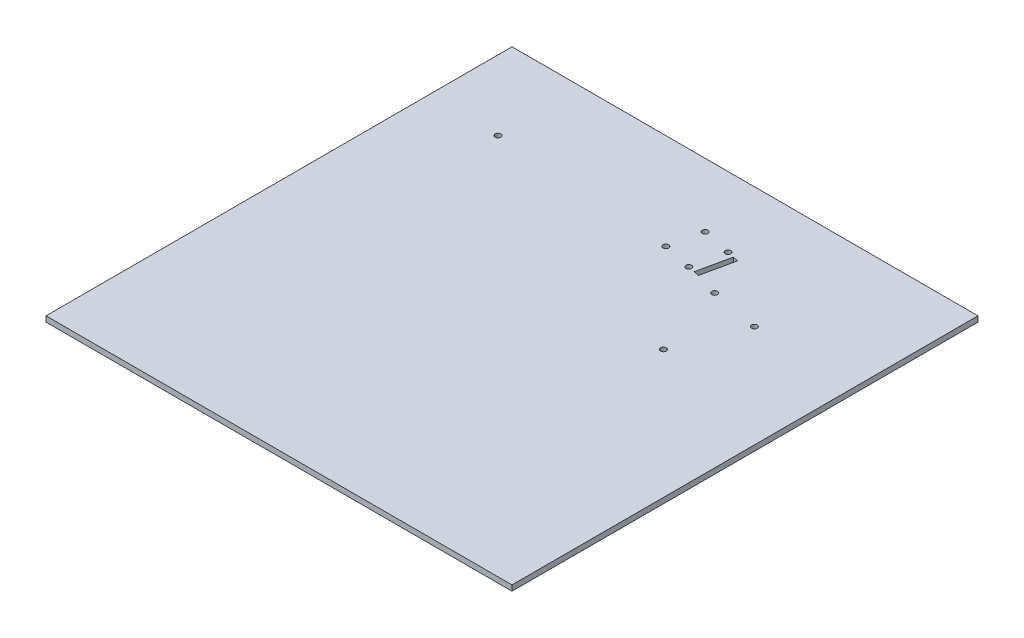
ISO-10303-21;
HEADER;
FILE_DESCRIPTION(('STEP AP214'),'2;1');
FILE_NAME('part.step','',(''),(''),'','','');
FILE_SCHEMA(('AUTOMOTIVE_DESIGN { 1 0 10303 214 1 1 1 1 }'));
ENDSEC;
DATA;
#1=APPLICATION_CONTEXT('core data for automotive mechanical design processes');
#2=APPLICATION_PROTOCOL_DEFINITION('international standard','automotive_design',2000,#1);
#3=PRODUCT_CONTEXT('',#1,'mechanical');
#4=PRODUCT('Part','Part','',(#3));
#5=PRODUCT_RELATED_PRODUCT_CATEGORY('part','',(#4));
#6=PRODUCT_DEFINITION_FORMATION('','',#4);
#7=PRODUCT_DEFINITION_CONTEXT('part definition',#1,'design');
#8=PRODUCT_DEFINITION('design','',#6,#7);
#9=PRODUCT_DEFINITION_SHAPE('','',#8);
#10=(LENGTH_UNIT() NAMED_UNIT(*) SI_UNIT(.MILLI.,.METRE.));
#11=(NAMED_UNIT(*) PLANE_ANGLE_UNIT() SI_UNIT($,.RADIAN.));
#12=(NAMED_UNIT(*) SI_UNIT($,.STERADIAN.) SOLID_ANGLE_UNIT());
#13=UNCERTAINTY_MEASURE_WITH_UNIT(LENGTH_MEASURE(1.E-05),#10,'distance_accuracy_value','');
#14=(GEOMETRIC_REPRESENTATION_CONTEXT(3) GLOBAL_UNCERTAINTY_ASSIGNED_CONTEXT((#13)) GLOBAL_UNIT_ASSIGNED_CONTEXT((#10,
#11,#12)) REPRESENTATION_CONTEXT('',''));
#15=CARTESIAN_POINT('',(0.,0.,0.));
#16=DIRECTION('',(0.,0.,1.));
#17=DIRECTION('',(1.,0.,0.));
#18=AXIS2_PLACEMENT_3D('',#15,#16,#17);
#19=CARTESIAN_POINT('',(0.,2.999994,0.));
#20=DIRECTION('',(0.,1.,0.));
#21=DIRECTION('',(0.,0.,1.));
#22=AXIS2_PLACEMENT_3D('',#19,#20,#21);
#23=PLANE('',#22);
#24=CARTESIAN_POINT('',(25.0680233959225,2.999994,-71.2861191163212));
#25=DIRECTION('',(0.,1.,0.));
#26=DIRECTION('',(0.,0.,1.));
#27=AXIS2_PLACEMENT_3D('',#24,#25,#26);
#28=CIRCLE('',#27,1.5499842);
#29=CARTESIAN_POINT('',(25.0680233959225,2.999994,-69.7361349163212));
#30=VERTEX_POINT('',#29);
#31=EDGE_CURVE('E287',#30,#30,#28,.T.);
#32=ORIENTED_EDGE('',*,*,#31,.F.);
#33=EDGE_LOOP('',(#32));
#34=FACE_BOUND('',#33,.T.);
#35=CARTESIAN_POINT('',(12.9667589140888,2.999994,-92.2781036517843));
#36=DIRECTION('',(0.,1.,0.));
#37=DIRECTION('',(0.,0.,1.));
#38=AXIS2_PLACEMENT_3D('',#35,#36,#37);
#39=CIRCLE('',#38,1.5499842);
#40=CARTESIAN_POINT('',(12.9667589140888,2.999994,-90.7281194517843));
#41=VERTEX_POINT('',#40);
#42=EDGE_CURVE('E299',#41,#41,#39,.T.);
#43=ORIENTED_EDGE('',*,*,#42,.F.);
#44=EDGE_LOOP('',(#43));
#45=FACE_BOUND('',#44,.T.);
#46=DIRECTION('',(-0.977674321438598,0.,-0.210125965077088));
#47=VECTOR('',#46,1.);
#48=CARTESIAN_POINT('',(32.6243776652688,2.999994,-88.0532037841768));
#49=LINE('',#48,#47);
#50=CARTESIAN_POINT('',(35.5281771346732,2.999994,-87.4291067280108));
#51=VERTEX_POINT('',#50);
#52=CARTESIAN_POINT('',(32.6243776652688,2.999994,-88.0532037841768));
#53=VERTEX_POINT('',#52);
#54=EDGE_CURVE('E106',#51,#53,#49,.T.);
#55=ORIENTED_EDGE('',*,*,#54,.F.);
#56=DIRECTION('',(0.210125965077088,0.,-0.977674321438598));
#57=VECTOR('',#56,1.);
#58=CARTESIAN_POINT('',(35.5281771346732,2.999994,-87.4291067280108));
#59=LINE('',#58,#57);
#60=CARTESIAN_POINT('',(31.75,2.999994,-69.85));
#61=VERTEX_POINT('',#60);
#62=EDGE_CURVE('E98',#61,#51,#59,.T.);
#63=ORIENTED_EDGE('',*,*,#62,.F.);
#64=DIRECTION('',(0.977674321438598,0.,0.210125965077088));
#65=VECTOR('',#64,1.);
#66=CARTESIAN_POINT('',(31.75,2.999994,-69.85));
#67=LINE('',#66,#65);
#68=CARTESIAN_POINT('',(28.8462005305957,2.999994,-70.474097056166));
#69=VERTEX_POINT('',#68);
#70=EDGE_CURVE('E121',#69,#61,#67,.T.);
#71=ORIENTED_EDGE('',*,*,#70,.F.);
#72=DIRECTION('',(-0.210125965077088,0.,0.977674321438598));
#73=VECTOR('',#72,1.);
#74=CARTESIAN_POINT('',(28.8462005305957,2.999994,-70.474097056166));
#75=LINE('',#74,#73);
#76=EDGE_CURVE('E119',#53,#69,#75,.T.);
#77=ORIENTED_EDGE('',*,*,#76,.F.);
#78=EDGE_LOOP('',(#55,#63,#71,#77));
#79=FACE_BOUND('',#78,.T.);
#80=CARTESIAN_POINT('',(44.45,2.999994,-66.04));
#81=DIRECTION('',(0.,1.,0.));
#82=DIRECTION('',(0.,0.,1.));
#83=AXIS2_PLACEMENT_3D('',#80,#81,#82);
#84=CIRCLE('',#83,1.5499842);
#85=CARTESIAN_POINT('',(44.45,2.999994,-64.4900158));
#86=VERTEX_POINT('',#85);
#87=EDGE_CURVE('E137',#86,#86,#84,.T.);
#88=ORIENTED_EDGE('',*,*,#87,.F.);
#89=EDGE_LOOP('',(#88));
#90=FACE_BOUND('',#89,.T.);
#91=CARTESIAN_POINT('',(57.15,2.999994,-25.4));
#92=DIRECTION('',(0.,1.,0.));
#93=DIRECTION('',(0.,0.,1.));
#94=AXIS2_PLACEMENT_3D('',#91,#92,#93);
#95=CIRCLE('',#94,1.5499842);
#96=CARTESIAN_POINT('',(57.15,2.999994,-23.8500158));
#97=VERTEX_POINT('',#96);
#98=EDGE_CURVE('E149',#97,#97,#95,.T.);
#99=ORIENTED_EDGE('',*,*,#98,.F.);
#100=EDGE_LOOP('',(#99));
#101=FACE_BOUND('',#100,.T.);
#102=DIRECTION('',(0.,0.,-1.));
#103=VECTOR('',#102,1.);
#104=CARTESIAN_POINT('',(127.,2.999994,-127.));
#105=LINE('',#104,#103);
#106=CARTESIAN_POINT('',(127.,2.999994,127.));
#107=VERTEX_POINT('',#106);
#108=CARTESIAN_POINT('',(127.,2.999994,-127.));
#109=VERTEX_POINT('',#108);
#110=EDGE_CURVE('E155',#107,#109,#105,.T.);
#111=ORIENTED_EDGE('',*,*,#110,.T.);
#112=DIRECTION('',(-1.,0.,0.));
#113=VECTOR('',#112,1.);
#114=CARTESIAN_POINT('',(-127.,2.999994,-127.));
#115=LINE('',#114,#113);
#116=CARTESIAN_POINT('',(-127.,2.999994,-127.));
#117=VERTEX_POINT('',#116);
#118=EDGE_CURVE('E158',#109,#117,#115,.T.);
#119=ORIENTED_EDGE('',*,*,#118,.T.);
#120=DIRECTION('',(0.,0.,1.));
#121=VECTOR('',#120,1.);
#122=CARTESIAN_POINT('',(-127.,2.999994,-127.));
#123=LINE('',#122,#121);
#124=CARTESIAN_POINT('',(-127.,2.999994,127.));
#125=VERTEX_POINT('',#124);
#126=EDGE_CURVE('E161',#117,#125,#123,.T.);
#127=ORIENTED_EDGE('',*,*,#126,.T.);
#128=DIRECTION('',(1.,0.,0.));
#129=VECTOR('',#128,1.);
#130=CARTESIAN_POINT('',(-127.,2.999994,127.));
#131=LINE('',#130,#129);
#132=EDGE_CURVE('E163',#125,#107,#131,.T.);
#133=ORIENTED_EDGE('',*,*,#132,.T.);
#134=EDGE_LOOP('',(#111,#119,#127,#133));
#135=FACE_BOUND('',#134,.T.);
#136=CARTESIAN_POINT('',(71.12,2.999994,-60.96));
#137=DIRECTION('',(0.,1.,0.));
#138=DIRECTION('',(0.,0.,1.));
#139=AXIS2_PLACEMENT_3D('',#136,#137,#138);
#140=CIRCLE('',#139,1.5499842);
#141=CARTESIAN_POINT('',(71.12,2.999994,-59.4100158));
#142=VERTEX_POINT('',#141);
#143=EDGE_CURVE('E143',#142,#142,#140,.T.);
#144=ORIENTED_EDGE('',*,*,#143,.F.);
#145=EDGE_LOOP('',(#144));
#146=FACE_BOUND('',#145,.T.);
#147=CARTESIAN_POINT('',(9.1885817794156,2.999994,-74.6989969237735));
#148=DIRECTION('',(0.,1.,0.));
#149=DIRECTION('',(0.,0.,1.));
#150=AXIS2_PLACEMENT_3D('',#147,#148,#149);
#151=CIRCLE('',#150,1.5499842);
#152=CARTESIAN_POINT('',(9.1885817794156,2.999994,-73.1490127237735));
#153=VERTEX_POINT('',#152);
#154=EDGE_CURVE('E127',#153,#153,#151,.T.);
#155=ORIENTED_EDGE('',*,*,#154,.F.);
#156=EDGE_LOOP('',(#155));
#157=FACE_BOUND('',#156,.T.);
#158=CARTESIAN_POINT('',(28.8462005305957,2.999994,-88.865225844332));
#159=DIRECTION('',(0.,1.,0.));
#160=DIRECTION('',(0.,0.,1.));
#161=AXIS2_PLACEMENT_3D('',#158,#159,#160);
#162=CIRCLE('',#161,1.5499842);
#163=CARTESIAN_POINT('',(28.8462005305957,2.999994,-87.315241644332));
#164=VERTEX_POINT('',#163);
#165=EDGE_CURVE('E293',#164,#164,#162,.T.);
#166=ORIENTED_EDGE('',*,*,#165,.F.);
#167=EDGE_LOOP('',(#166));
#168=FACE_BOUND('',#167,.T.);
#169=CARTESIAN_POINT('',(-88.9,2.999994,-81.28));
#170=DIRECTION('',(0.,1.,0.));
#171=DIRECTION('',(0.,0.,1.));
#172=AXIS2_PLACEMENT_3D('',#169,#170,#171);
#173=CIRCLE('',#172,1.5499842);
#174=CARTESIAN_POINT('',(-88.9,2.999994,-79.7300158));
#175=VERTEX_POINT('',#174);
#176=EDGE_CURVE('E278',#175,#175,#173,.T.);
#177=ORIENTED_EDGE('',*,*,#176,.F.);
#178=EDGE_LOOP('',(#177));
#179=FACE_BOUND('',#178,.T.);
#180=ADVANCED_FACE('F33',(#34,#45,#79,#90,#101,#135,#146,#157,#168,#179),#23,.T.);
#181=CARTESIAN_POINT('',(0.,0.,0.));
#182=DIRECTION('',(0.,1.,0.));
#183=DIRECTION('',(0.,0.,1.));
#184=AXIS2_PLACEMENT_3D('',#181,#182,#183);
#185=PLANE('',#184);
#186=CARTESIAN_POINT('',(44.45,0.,-66.04));
#187=DIRECTION('',(0.,1.,0.));
#188=DIRECTION('',(0.,0.,1.));
#189=AXIS2_PLACEMENT_3D('',#186,#187,#188);
#190=CIRCLE('',#189,1.5499842);
#191=CARTESIAN_POINT('',(44.45,0.,-64.4900158));
#192=VERTEX_POINT('',#191);
#193=EDGE_CURVE('E114',#192,#192,#190,.T.);
#194=ORIENTED_EDGE('',*,*,#193,.T.);
#195=EDGE_LOOP('',(#194));
#196=FACE_BOUND('',#195,.T.);
#197=CARTESIAN_POINT('',(71.12,0.,-60.96));
#198=DIRECTION('',(0.,1.,0.));
#199=DIRECTION('',(0.,0.,1.));
#200=AXIS2_PLACEMENT_3D('',#197,#198,#199);
#201=CIRCLE('',#200,1.5499842);
#202=CARTESIAN_POINT('',(71.12,0.,-59.4100158));
#203=VERTEX_POINT('',#202);
#204=EDGE_CURVE('E140',#203,#203,#201,.T.);
#205=ORIENTED_EDGE('',*,*,#204,.T.);
#206=EDGE_LOOP('',(#205));
#207=FACE_BOUND('',#206,.T.);
#208=CARTESIAN_POINT('',(57.15,0.,-25.4));
#209=DIRECTION('',(0.,1.,0.));
#210=DIRECTION('',(0.,0.,1.));
#211=AXIS2_PLACEMENT_3D('',#208,#209,#210);
#212=CIRCLE('',#211,1.5499842);
#213=CARTESIAN_POINT('',(57.15,0.,-23.8500158));
#214=VERTEX_POINT('',#213);
#215=EDGE_CURVE('E146',#214,#214,#212,.T.);
#216=ORIENTED_EDGE('',*,*,#215,.T.);
#217=EDGE_LOOP('',(#216));
#218=FACE_BOUND('',#217,.T.);
#219=DIRECTION('',(0.,0.,-1.));
#220=VECTOR('',#219,1.);
#221=CARTESIAN_POINT('',(127.,0.,-127.));
#222=LINE('',#221,#220);
#223=CARTESIAN_POINT('',(127.,0.,127.));
#224=VERTEX_POINT('',#223);
#225=CARTESIAN_POINT('',(127.,0.,-127.));
#226=VERTEX_POINT('',#225);
#227=EDGE_CURVE('E152',#224,#226,#222,.T.);
#228=ORIENTED_EDGE('',*,*,#227,.F.);
#229=DIRECTION('',(1.,0.,0.));
#230=VECTOR('',#229,1.);
#231=CARTESIAN_POINT('',(-127.,0.,127.));
#232=LINE('',#231,#230);
#233=CARTESIAN_POINT('',(-127.,0.,127.));
#234=VERTEX_POINT('',#233);
#235=EDGE_CURVE('E159',#234,#224,#232,.T.);
#236=ORIENTED_EDGE('',*,*,#235,.F.);
#237=DIRECTION('',(0.,0.,1.));
#238=VECTOR('',#237,1.);
#239=CARTESIAN_POINT('',(-127.,0.,-127.));
#240=LINE('',#239,#238);
#241=CARTESIAN_POINT('',(-127.,0.,-127.));
#242=VERTEX_POINT('',#241);
#243=EDGE_CURVE('E170',#242,#234,#240,.T.);
#244=ORIENTED_EDGE('',*,*,#243,.F.);
#245=DIRECTION('',(-1.,0.,0.));
#246=VECTOR('',#245,1.);
#247=CARTESIAN_POINT('',(-127.,0.,-127.));
#248=LINE('',#247,#246);
#249=EDGE_CURVE('E168',#226,#242,#248,.T.);
#250=ORIENTED_EDGE('',*,*,#249,.F.);
#251=EDGE_LOOP('',(#228,#236,#244,#250));
#252=FACE_BOUND('',#251,.T.);
#253=DIRECTION('',(0.210125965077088,0.,-0.977674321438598));
#254=VECTOR('',#253,1.);
#255=CARTESIAN_POINT('',(35.5281771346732,0.,-87.4291067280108));
#256=LINE('',#255,#254);
#257=CARTESIAN_POINT('',(31.75,0.,-69.85));
#258=VERTEX_POINT('',#257);
#259=CARTESIAN_POINT('',(35.5281771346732,0.,-87.4291067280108));
#260=VERTEX_POINT('',#259);
#261=EDGE_CURVE('E56',#258,#260,#256,.T.);
#262=ORIENTED_EDGE('',*,*,#261,.T.);
#263=DIRECTION('',(-0.977674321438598,0.,-0.210125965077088));
#264=VECTOR('',#263,1.);
#265=CARTESIAN_POINT('',(32.6243776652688,0.,-88.0532037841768));
#266=LINE('',#265,#264);
#267=CARTESIAN_POINT('',(32.6243776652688,0.,-88.0532037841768));
#268=VERTEX_POINT('',#267);
#269=EDGE_CURVE('E113',#260,#268,#266,.T.);
#270=ORIENTED_EDGE('',*,*,#269,.T.);
#271=DIRECTION('',(-0.210125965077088,0.,0.977674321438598));
#272=VECTOR('',#271,1.);
#273=CARTESIAN_POINT('',(28.8462005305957,0.,-70.474097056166));
#274=LINE('',#273,#272);
#275=CARTESIAN_POINT('',(28.8462005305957,0.,-70.474097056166));
#276=VERTEX_POINT('',#275);
#277=EDGE_CURVE('E129',#268,#276,#274,.T.);
#278=ORIENTED_EDGE('',*,*,#277,.T.);
#279=DIRECTION('',(0.977674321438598,0.,0.210125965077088));
#280=VECTOR('',#279,1.);
#281=CARTESIAN_POINT('',(31.75,0.,-69.85));
#282=LINE('',#281,#280);
#283=EDGE_CURVE('E107',#276,#258,#282,.T.);
#284=ORIENTED_EDGE('',*,*,#283,.T.);
#285=EDGE_LOOP('',(#262,#270,#278,#284));
#286=FACE_BOUND('',#285,.T.);
#287=CARTESIAN_POINT('',(9.1885817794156,0.,-74.6989969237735));
#288=DIRECTION('',(0.,1.,0.));
#289=DIRECTION('',(0.,0.,1.));
#290=AXIS2_PLACEMENT_3D('',#287,#288,#289);
#291=CIRCLE('',#290,1.5499842);
#292=CARTESIAN_POINT('',(9.1885817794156,0.,-73.1490127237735));
#293=VERTEX_POINT('',#292);
#294=EDGE_CURVE('E302',#293,#293,#291,.T.);
#295=ORIENTED_EDGE('',*,*,#294,.T.);
#296=EDGE_LOOP('',(#295));
#297=FACE_BOUND('',#296,.T.);
#298=CARTESIAN_POINT('',(12.9667589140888,0.,-92.2781036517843));
#299=DIRECTION('',(0.,1.,0.));
#300=DIRECTION('',(0.,0.,1.));
#301=AXIS2_PLACEMENT_3D('',#298,#299,#300);
#302=CIRCLE('',#301,1.5499842);
#303=CARTESIAN_POINT('',(12.9667589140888,0.,-90.7281194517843));
#304=VERTEX_POINT('',#303);
#305=EDGE_CURVE('E296',#304,#304,#302,.T.);
#306=ORIENTED_EDGE('',*,*,#305,.T.);
#307=EDGE_LOOP('',(#306));
#308=FACE_BOUND('',#307,.T.);
#309=CARTESIAN_POINT('',(28.8462005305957,0.,-88.865225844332));
#310=DIRECTION('',(0.,1.,0.));
#311=DIRECTION('',(0.,0.,1.));
#312=AXIS2_PLACEMENT_3D('',#309,#310,#311);
#313=CIRCLE('',#312,1.5499842);
#314=CARTESIAN_POINT('',(28.8462005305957,0.,-87.315241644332));
#315=VERTEX_POINT('',#314);
#316=EDGE_CURVE('E290',#315,#315,#313,.T.);
#317=ORIENTED_EDGE('',*,*,#316,.T.);
#318=EDGE_LOOP('',(#317));
#319=FACE_BOUND('',#318,.T.);
#320=CARTESIAN_POINT('',(25.0680233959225,0.,-71.2861191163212));
#321=DIRECTION('',(0.,1.,0.));
#322=DIRECTION('',(0.,0.,1.));
#323=AXIS2_PLACEMENT_3D('',#320,#321,#322);
#324=CIRCLE('',#323,1.5499842);
#325=CARTESIAN_POINT('',(25.0680233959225,0.,-69.7361349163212));
#326=VERTEX_POINT('',#325);
#327=EDGE_CURVE('E284',#326,#326,#324,.T.);
#328=ORIENTED_EDGE('',*,*,#327,.T.);
#329=EDGE_LOOP('',(#328));
#330=FACE_BOUND('',#329,.T.);
#331=CARTESIAN_POINT('',(-88.9,0.,-81.28));
#332=DIRECTION('',(0.,1.,0.));
#333=DIRECTION('',(0.,0.,1.));
#334=AXIS2_PLACEMENT_3D('',#331,#332,#333);
#335=CIRCLE('',#334,1.5499842);
#336=CARTESIAN_POINT('',(-88.9,0.,-79.7300158));
#337=VERTEX_POINT('',#336);
#338=EDGE_CURVE('E281',#337,#337,#335,.T.);
#339=ORIENTED_EDGE('',*,*,#338,.T.);
#340=EDGE_LOOP('',(#339));
#341=FACE_BOUND('',#340,.T.);
#342=ADVANCED_FACE('F188',(#196,#207,#218,#252,#286,#297,#308,#319,#330,#341),#185,.F.);
#343=CARTESIAN_POINT('',(127.,2.999994,-127.));
#344=DIRECTION('',(-1.,0.,0.));
#345=DIRECTION('',(0.,0.,1.));
#346=AXIS2_PLACEMENT_3D('',#343,#344,#345);
#347=PLANE('',#346);
#348=ORIENTED_EDGE('',*,*,#227,.T.);
#349=DIRECTION('',(0.,-1.,0.));
#350=VECTOR('',#349,1.);
#351=CARTESIAN_POINT('',(127.,2.999994,-127.));
#352=LINE('',#351,#350);
#353=EDGE_CURVE('E11',#109,#226,#352,.T.);
#354=ORIENTED_EDGE('',*,*,#353,.F.);
#355=ORIENTED_EDGE('',*,*,#110,.F.);
#356=DIRECTION('',(0.,-1.,0.));
#357=VECTOR('',#356,1.);
#358=CARTESIAN_POINT('',(127.,2.999994,127.));
#359=LINE('',#358,#357);
#360=EDGE_CURVE('E165',#107,#224,#359,.T.);
#361=ORIENTED_EDGE('',*,*,#360,.T.);
#362=EDGE_LOOP('',(#348,#354,#355,#361));
#363=FACE_BOUND('',#362,.T.);
#364=ADVANCED_FACE('F35',(#363),#347,.F.);
#365=CARTESIAN_POINT('',(-127.,2.999994,-127.));
#366=DIRECTION('',(0.,0.,1.));
#367=DIRECTION('',(1.,0.,0.));
#368=AXIS2_PLACEMENT_3D('',#365,#366,#367);
#369=PLANE('',#368);
#370=ORIENTED_EDGE('',*,*,#249,.T.);
#371=DIRECTION('',(0.,-1.,0.));
#372=VECTOR('',#371,1.);
#373=CARTESIAN_POINT('',(-127.,2.999994,-127.));
#374=LINE('',#373,#372);
#375=EDGE_CURVE('E41',#117,#242,#374,.T.);
#376=ORIENTED_EDGE('',*,*,#375,.F.);
#377=ORIENTED_EDGE('',*,*,#118,.F.);
#378=ORIENTED_EDGE('',*,*,#353,.T.);
#379=EDGE_LOOP('',(#370,#376,#377,#378));
#380=FACE_BOUND('',#379,.T.);
#381=ADVANCED_FACE('F199',(#380),#369,.F.);
#382=CARTESIAN_POINT('',(-127.,2.999994,-127.));
#383=DIRECTION('',(1.,0.,0.));
#384=DIRECTION('',(0.,0.,-1.));
#385=AXIS2_PLACEMENT_3D('',#382,#383,#384);
#386=PLANE('',#385);
#387=ORIENTED_EDGE('',*,*,#243,.T.);
#388=DIRECTION('',(0.,-1.,0.));
#389=VECTOR('',#388,1.);
#390=CARTESIAN_POINT('',(-127.,2.999994,127.));
#391=LINE('',#390,#389);
#392=EDGE_CURVE('E175',#125,#234,#391,.T.);
#393=ORIENTED_EDGE('',*,*,#392,.F.);
#394=ORIENTED_EDGE('',*,*,#126,.F.);
#395=ORIENTED_EDGE('',*,*,#375,.T.);
#396=EDGE_LOOP('',(#387,#393,#394,#395));
#397=FACE_BOUND('',#396,.T.);
#398=ADVANCED_FACE('F182',(#397),#386,.F.);
#399=CARTESIAN_POINT('',(-127.,2.999994,127.));
#400=DIRECTION('',(0.,0.,-1.));
#401=DIRECTION('',(-1.,0.,0.));
#402=AXIS2_PLACEMENT_3D('',#399,#400,#401);
#403=PLANE('',#402);
#404=ORIENTED_EDGE('',*,*,#235,.T.);
#405=ORIENTED_EDGE('',*,*,#360,.F.);
#406=ORIENTED_EDGE('',*,*,#132,.F.);
#407=ORIENTED_EDGE('',*,*,#392,.T.);
#408=EDGE_LOOP('',(#404,#405,#406,#407));
#409=FACE_BOUND('',#408,.T.);
#410=ADVANCED_FACE('F192',(#409),#403,.F.);
#411=CARTESIAN_POINT('',(57.15,2.999994,-25.4));
#412=DIRECTION('',(0.,-1.,0.));
#413=DIRECTION('',(0.,0.,-1.));
#414=AXIS2_PLACEMENT_3D('',#411,#412,#413);
#415=CYLINDRICAL_SURFACE('',#414,1.5499842);
#416=ORIENTED_EDGE('',*,*,#98,.T.);
#417=EDGE_LOOP('',(#416));
#418=FACE_BOUND('',#417,.T.);
#419=ORIENTED_EDGE('',*,*,#215,.F.);
#420=EDGE_LOOP('',(#419));
#421=FACE_BOUND('',#420,.T.);
#422=ADVANCED_FACE('F217',(#418,#421),#415,.F.);
#423=CARTESIAN_POINT('',(71.12,2.999994,-60.96));
#424=DIRECTION('',(0.,-1.,0.));
#425=DIRECTION('',(0.,0.,-1.));
#426=AXIS2_PLACEMENT_3D('',#423,#424,#425);
#427=CYLINDRICAL_SURFACE('',#426,1.5499842);
#428=ORIENTED_EDGE('',*,*,#143,.T.);
#429=EDGE_LOOP('',(#428));
#430=FACE_BOUND('',#429,.T.);
#431=ORIENTED_EDGE('',*,*,#204,.F.);
#432=EDGE_LOOP('',(#431));
#433=FACE_BOUND('',#432,.T.);
#434=ADVANCED_FACE('F224',(#430,#433),#427,.F.);
#435=CARTESIAN_POINT('',(44.45,2.999994,-66.04));
#436=DIRECTION('',(0.,-1.,0.));
#437=DIRECTION('',(0.,0.,-1.));
#438=AXIS2_PLACEMENT_3D('',#435,#436,#437);
#439=CYLINDRICAL_SURFACE('',#438,1.5499842);
#440=ORIENTED_EDGE('',*,*,#87,.T.);
#441=EDGE_LOOP('',(#440));
#442=FACE_BOUND('',#441,.T.);
#443=ORIENTED_EDGE('',*,*,#193,.F.);
#444=EDGE_LOOP('',(#443));
#445=FACE_BOUND('',#444,.T.);
#446=ADVANCED_FACE('F229',(#442,#445),#439,.F.);
#447=CARTESIAN_POINT('',(35.5281771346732,2.999994,-87.4291067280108));
#448=DIRECTION('',(-0.977674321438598,0.,-0.210125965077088));
#449=DIRECTION('',(-0.210125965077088,0.,0.977674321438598));
#450=AXIS2_PLACEMENT_3D('',#447,#448,#449);
#451=PLANE('',#450);
#452=ORIENTED_EDGE('',*,*,#261,.F.);
#453=DIRECTION('',(0.,-1.,0.));
#454=VECTOR('',#453,1.);
#455=CARTESIAN_POINT('',(31.75,2.999994,-69.85));
#456=LINE('',#455,#454);
#457=EDGE_CURVE('E102',#61,#258,#456,.T.);
#458=ORIENTED_EDGE('',*,*,#457,.F.);
#459=ORIENTED_EDGE('',*,*,#62,.T.);
#460=DIRECTION('',(0.,-1.,0.));
#461=VECTOR('',#460,1.);
#462=CARTESIAN_POINT('',(35.5281771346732,2.999994,-87.4291067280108));
#463=LINE('',#462,#461);
#464=EDGE_CURVE('E101',#51,#260,#463,.T.);
#465=ORIENTED_EDGE('',*,*,#464,.T.);
#466=EDGE_LOOP('',(#452,#458,#459,#465));
#467=FACE_BOUND('',#466,.T.);
#468=ADVANCED_FACE('F100',(#467),#451,.T.);
#469=CARTESIAN_POINT('',(32.6243776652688,2.999994,-88.0532037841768));
#470=DIRECTION('',(-0.210125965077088,0.,0.977674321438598));
#471=DIRECTION('',(0.977674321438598,0.,0.210125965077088));
#472=AXIS2_PLACEMENT_3D('',#469,#470,#471);
#473=PLANE('',#472);
#474=ORIENTED_EDGE('',*,*,#269,.F.);
#475=ORIENTED_EDGE('',*,*,#464,.F.);
#476=ORIENTED_EDGE('',*,*,#54,.T.);
#477=DIRECTION('',(0.,-1.,0.));
#478=VECTOR('',#477,1.);
#479=CARTESIAN_POINT('',(32.6243776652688,2.999994,-88.0532037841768));
#480=LINE('',#479,#478);
#481=EDGE_CURVE('E115',#53,#268,#480,.T.);
#482=ORIENTED_EDGE('',*,*,#481,.T.);
#483=EDGE_LOOP('',(#474,#475,#476,#482));
#484=FACE_BOUND('',#483,.T.);
#485=ADVANCED_FACE('F110',(#484),#473,.T.);
#486=CARTESIAN_POINT('',(28.8462005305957,2.999994,-70.474097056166));
#487=DIRECTION('',(0.977674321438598,0.,0.210125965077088));
#488=DIRECTION('',(0.210125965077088,0.,-0.977674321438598));
#489=AXIS2_PLACEMENT_3D('',#486,#487,#488);
#490=PLANE('',#489);
#491=ORIENTED_EDGE('',*,*,#277,.F.);
#492=ORIENTED_EDGE('',*,*,#481,.F.);
#493=ORIENTED_EDGE('',*,*,#76,.T.);
#494=DIRECTION('',(0.,-1.,0.));
#495=VECTOR('',#494,1.);
#496=CARTESIAN_POINT('',(28.8462005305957,2.999994,-70.474097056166));
#497=LINE('',#496,#495);
#498=EDGE_CURVE('E48',#69,#276,#497,.T.);
#499=ORIENTED_EDGE('',*,*,#498,.T.);
#500=EDGE_LOOP('',(#491,#492,#493,#499));
#501=FACE_BOUND('',#500,.T.);
#502=ADVANCED_FACE('F247',(#501),#490,.T.);
#503=CARTESIAN_POINT('',(31.75,2.999994,-69.85));
#504=DIRECTION('',(0.210125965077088,0.,-0.977674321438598));
#505=DIRECTION('',(-0.977674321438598,0.,-0.210125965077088));
#506=AXIS2_PLACEMENT_3D('',#503,#504,#505);
#507=PLANE('',#506);
#508=ORIENTED_EDGE('',*,*,#283,.F.);
#509=ORIENTED_EDGE('',*,*,#498,.F.);
#510=ORIENTED_EDGE('',*,*,#70,.T.);
#511=ORIENTED_EDGE('',*,*,#457,.T.);
#512=EDGE_LOOP('',(#508,#509,#510,#511));
#513=FACE_BOUND('',#512,.T.);
#514=ADVANCED_FACE('F250',(#513),#507,.T.);
#515=CARTESIAN_POINT('',(9.1885817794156,2.999994,-74.6989969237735));
#516=DIRECTION('',(0.,-1.,0.));
#517=DIRECTION('',(0.,0.,-1.));
#518=AXIS2_PLACEMENT_3D('',#515,#516,#517);
#519=CYLINDRICAL_SURFACE('',#518,1.5499842);
#520=ORIENTED_EDGE('',*,*,#154,.T.);
#521=EDGE_LOOP('',(#520));
#522=FACE_BOUND('',#521,.T.);
#523=ORIENTED_EDGE('',*,*,#294,.F.);
#524=EDGE_LOOP('',(#523));
#525=FACE_BOUND('',#524,.T.);
#526=ADVANCED_FACE('F254',(#522,#525),#519,.F.);
#527=CARTESIAN_POINT('',(12.9667589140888,2.999994,-92.2781036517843));
#528=DIRECTION('',(0.,-1.,0.));
#529=DIRECTION('',(0.,0.,-1.));
#530=AXIS2_PLACEMENT_3D('',#527,#528,#529);
#531=CYLINDRICAL_SURFACE('',#530,1.5499842);
#532=ORIENTED_EDGE('',*,*,#42,.T.);
#533=EDGE_LOOP('',(#532));
#534=FACE_BOUND('',#533,.T.);
#535=ORIENTED_EDGE('',*,*,#305,.F.);
#536=EDGE_LOOP('',(#535));
#537=FACE_BOUND('',#536,.T.);
#538=ADVANCED_FACE('F257',(#534,#537),#531,.F.);
#539=CARTESIAN_POINT('',(28.8462005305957,2.999994,-88.865225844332));
#540=DIRECTION('',(0.,-1.,0.));
#541=DIRECTION('',(0.,0.,-1.));
#542=AXIS2_PLACEMENT_3D('',#539,#540,#541);
#543=CYLINDRICAL_SURFACE('',#542,1.5499842);
#544=ORIENTED_EDGE('',*,*,#165,.T.);
#545=EDGE_LOOP('',(#544));
#546=FACE_BOUND('',#545,.T.);
#547=ORIENTED_EDGE('',*,*,#316,.F.);
#548=EDGE_LOOP('',(#547));
#549=FACE_BOUND('',#548,.T.);
#550=ADVANCED_FACE('F261',(#546,#549),#543,.F.);
#551=CARTESIAN_POINT('',(25.0680233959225,2.999994,-71.2861191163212));
#552=DIRECTION('',(0.,-1.,0.));
#553=DIRECTION('',(0.,0.,-1.));
#554=AXIS2_PLACEMENT_3D('',#551,#552,#553);
#555=CYLINDRICAL_SURFACE('',#554,1.5499842);
#556=ORIENTED_EDGE('',*,*,#31,.T.);
#557=EDGE_LOOP('',(#556));
#558=FACE_BOUND('',#557,.T.);
#559=ORIENTED_EDGE('',*,*,#327,.F.);
#560=EDGE_LOOP('',(#559));
#561=FACE_BOUND('',#560,.T.);
#562=ADVANCED_FACE('F265',(#558,#561),#555,.F.);
#563=CARTESIAN_POINT('',(-88.9,2.999994,-81.28));
#564=DIRECTION('',(0.,-1.,0.));
#565=DIRECTION('',(0.,0.,-1.));
#566=AXIS2_PLACEMENT_3D('',#563,#564,#565);
#567=CYLINDRICAL_SURFACE('',#566,1.5499842);
#568=ORIENTED_EDGE('',*,*,#176,.T.);
#569=EDGE_LOOP('',(#568));
#570=FACE_BOUND('',#569,.T.);
#571=ORIENTED_EDGE('',*,*,#338,.F.);
#572=EDGE_LOOP('',(#571));
#573=FACE_BOUND('',#572,.T.);
#574=ADVANCED_FACE('F269',(#570,#573),#567,.F.);
#575=CLOSED_SHELL('',(#180,#342,#364,#381,#398,#410,#422,#434,#446,#468,#485,#502,#514,#526,
#538,#550,#562,#574));
#576=MANIFOLD_SOLID_BREP('B2',#575);
#577=ADVANCED_BREP_SHAPE_REPRESENTATION('',(#18,#576),#14);
#578=SHAPE_DEFINITION_REPRESENTATION(#9,#577);
ENDSEC;
END-ISO-10303-21;
